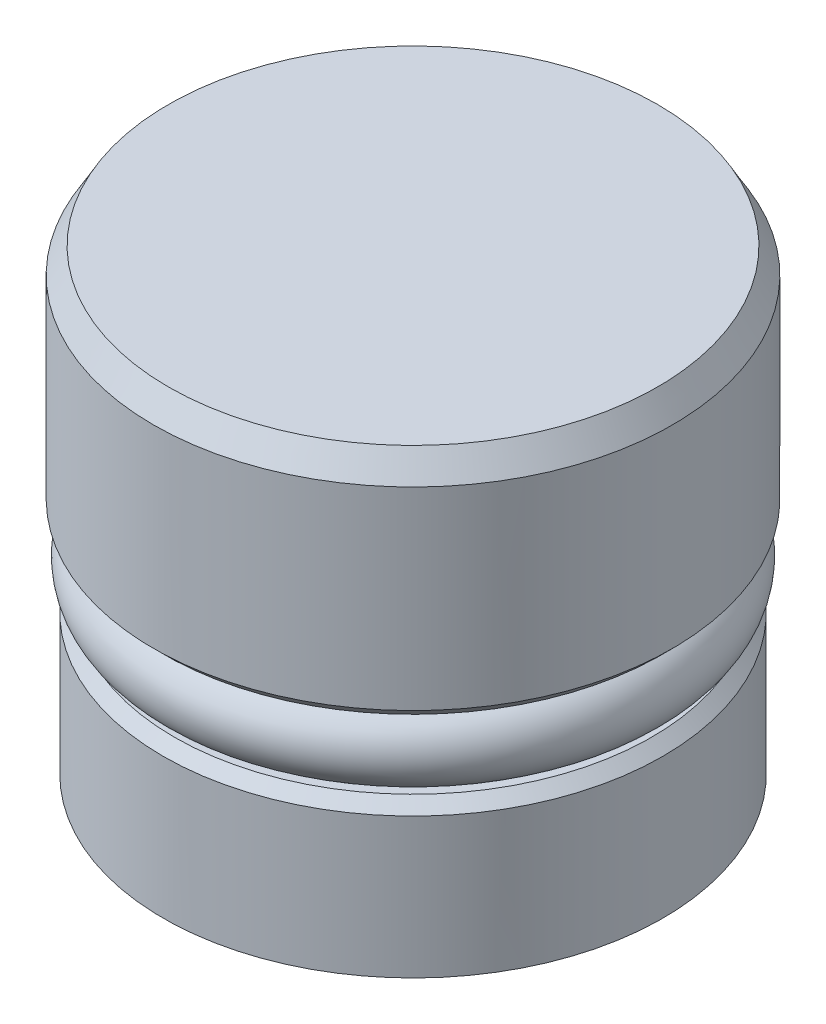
ISO-10303-21;
HEADER;
FILE_DESCRIPTION(('STEP AP214'),'2;1');
FILE_NAME('part.step','',(''),(''),'','','');
FILE_SCHEMA(('AUTOMOTIVE_DESIGN { 1 0 10303 214 1 1 1 1 }'));
ENDSEC;
DATA;
#1=APPLICATION_CONTEXT('core data for automotive mechanical design processes');
#2=APPLICATION_PROTOCOL_DEFINITION('international standard','automotive_design',2000,#1);
#3=PRODUCT_CONTEXT('',#1,'mechanical');
#4=PRODUCT('Part','Part','',(#3));
#5=PRODUCT_RELATED_PRODUCT_CATEGORY('part','',(#4));
#6=PRODUCT_DEFINITION_FORMATION('','',#4);
#7=PRODUCT_DEFINITION_CONTEXT('part definition',#1,'design');
#8=PRODUCT_DEFINITION('design','',#6,#7);
#9=PRODUCT_DEFINITION_SHAPE('','',#8);
#10=(LENGTH_UNIT() NAMED_UNIT(*) SI_UNIT(.MILLI.,.METRE.));
#11=(NAMED_UNIT(*) PLANE_ANGLE_UNIT() SI_UNIT($,.RADIAN.));
#12=(NAMED_UNIT(*) SI_UNIT($,.STERADIAN.) SOLID_ANGLE_UNIT());
#13=UNCERTAINTY_MEASURE_WITH_UNIT(LENGTH_MEASURE(1.E-05),#10,'distance_accuracy_value','');
#14=(GEOMETRIC_REPRESENTATION_CONTEXT(3) GLOBAL_UNCERTAINTY_ASSIGNED_CONTEXT((#13)) GLOBAL_UNIT_ASSIGNED_CONTEXT((#10,
#11,#12)) REPRESENTATION_CONTEXT('',''));
#15=CARTESIAN_POINT('',(0.,0.,0.));
#16=DIRECTION('',(0.,0.,1.));
#17=DIRECTION('',(1.,0.,0.));
#18=AXIS2_PLACEMENT_3D('',#15,#16,#17);
#19=CARTESIAN_POINT('',(0.,0.,0.));
#20=DIRECTION('',(0.,-1.,0.));
#21=DIRECTION('',(0.,0.,-1.));
#22=AXIS2_PLACEMENT_3D('',#19,#20,#21);
#23=PLANE('',#22);
#24=CARTESIAN_POINT('',(0.,0.,0.));
#25=DIRECTION('',(0.,-1.,0.));
#26=DIRECTION('',(0.,0.,-1.));
#27=AXIS2_PLACEMENT_3D('',#24,#25,#26);
#28=CIRCLE('',#27,5.5518939);
#29=CARTESIAN_POINT('',(0.,0.,-5.5518939));
#30=VERTEX_POINT('',#29);
#31=EDGE_CURVE('P0_E35',#30,#30,#28,.T.);
#32=ORIENTED_EDGE('',*,*,#31,.F.);
#33=EDGE_LOOP('',(#32));
#34=FACE_BOUND('',#33,.T.);
#35=CARTESIAN_POINT('',(0.,0.,0.));
#36=DIRECTION('',(0.,-1.,0.));
#37=DIRECTION('',(0.,0.,-1.));
#38=AXIS2_PLACEMENT_3D('',#35,#36,#37);
#39=CIRCLE('',#38,8.5979);
#40=CARTESIAN_POINT('',(0.,0.,-8.5979));
#41=VERTEX_POINT('',#40);
#42=EDGE_CURVE('P0_E55',#41,#41,#39,.T.);
#43=ORIENTED_EDGE('',*,*,#42,.T.);
#44=EDGE_LOOP('',(#43));
#45=FACE_BOUND('',#44,.T.);
#46=ADVANCED_FACE('P0_F15',(#34,#45),#23,.T.);
#47=CARTESIAN_POINT('',(0.,0.,0.));
#48=DIRECTION('',(0.,-1.,0.));
#49=DIRECTION('',(0.,0.,-1.));
#50=AXIS2_PLACEMENT_3D('',#47,#48,#49);
#51=CYLINDRICAL_SURFACE('',#50,8.5979);
#52=CARTESIAN_POINT('',(0.,4.826,0.));
#53=DIRECTION('',(0.,1.,0.));
#54=DIRECTION('',(0.,0.,1.));
#55=AXIS2_PLACEMENT_3D('',#52,#53,#54);
#56=CIRCLE('',#55,8.5979);
#57=CARTESIAN_POINT('',(0.,4.826,8.5979));
#58=VERTEX_POINT('',#57);
#59=EDGE_CURVE('P0_E58',#58,#58,#56,.F.);
#60=ORIENTED_EDGE('',*,*,#59,.T.);
#61=EDGE_LOOP('',(#60));
#62=FACE_BOUND('',#61,.T.);
#63=ORIENTED_EDGE('',*,*,#42,.F.);
#64=EDGE_LOOP('',(#63));
#65=FACE_BOUND('',#64,.T.);
#66=ADVANCED_FACE('P0_F86',(#62,#65),#51,.T.);
#67=CARTESIAN_POINT('',(8.5979,5.207,0.));
#68=DIRECTION('',(0.,1.,0.));
#69=DIRECTION('',(0.,0.,1.));
#70=AXIS2_PLACEMENT_3D('',#67,#68,#69);
#71=PLANE('',#70);
#72=CARTESIAN_POINT('',(0.,5.207,0.));
#73=DIRECTION('',(0.,1.,0.));
#74=DIRECTION('',(0.,0.,1.));
#75=AXIS2_PLACEMENT_3D('',#72,#73,#74);
#76=CIRCLE('',#75,8.2169);
#77=CARTESIAN_POINT('',(0.,5.207,8.2169));
#78=VERTEX_POINT('',#77);
#79=EDGE_CURVE('P0_E61',#78,#78,#76,.T.);
#80=ORIENTED_EDGE('',*,*,#79,.T.);
#81=EDGE_LOOP('',(#80));
#82=FACE_BOUND('',#81,.T.);
#83=CARTESIAN_POINT('',(0.,5.207,0.));
#84=DIRECTION('',(0.,-1.,0.));
#85=DIRECTION('',(0.,0.,-1.));
#86=AXIS2_PLACEMENT_3D('',#83,#84,#85);
#87=CIRCLE('',#86,6.0579);
#88=CARTESIAN_POINT('',(0.,5.207,-6.0579));
#89=VERTEX_POINT('',#88);
#90=EDGE_CURVE('P0_E52',#89,#89,#87,.T.);
#91=ORIENTED_EDGE('',*,*,#90,.T.);
#92=EDGE_LOOP('',(#91));
#93=FACE_BOUND('',#92,.T.);
#94=ADVANCED_FACE('P0_F92',(#82,#93),#71,.T.);
#95=CARTESIAN_POINT('',(0.,0.,0.));
#96=DIRECTION('',(0.,-1.,0.));
#97=DIRECTION('',(0.,0.,-1.));
#98=AXIS2_PLACEMENT_3D('',#95,#96,#97);
#99=CYLINDRICAL_SURFACE('',#98,6.0579);
#100=CARTESIAN_POINT('',(0.,7.8232,0.));
#101=DIRECTION('',(0.,-1.,0.));
#102=DIRECTION('',(0.,0.,-1.));
#103=AXIS2_PLACEMENT_3D('',#100,#101,#102);
#104=CIRCLE('',#103,6.0579);
#105=CARTESIAN_POINT('',(0.,7.8232,-6.0579));
#106=VERTEX_POINT('',#105);
#107=EDGE_CURVE('P0_E49',#106,#106,#104,.T.);
#108=ORIENTED_EDGE('',*,*,#107,.T.);
#109=EDGE_LOOP('',(#108));
#110=FACE_BOUND('',#109,.T.);
#111=ORIENTED_EDGE('',*,*,#90,.F.);
#112=EDGE_LOOP('',(#111));
#113=FACE_BOUND('',#112,.T.);
#114=ADVANCED_FACE('P0_F113',(#110,#113),#99,.T.);
#115=CARTESIAN_POINT('',(6.0579,7.8232,0.));
#116=DIRECTION('',(0.,-1.,0.));
#117=DIRECTION('',(0.,0.,-1.));
#118=AXIS2_PLACEMENT_3D('',#115,#116,#117);
#119=PLANE('',#118);
#120=CARTESIAN_POINT('',(0.,7.8232,0.));
#121=DIRECTION('',(0.,-1.,0.));
#122=DIRECTION('',(0.,0.,-1.));
#123=AXIS2_PLACEMENT_3D('',#120,#121,#122);
#124=CIRCLE('',#123,8.5471);
#125=CARTESIAN_POINT('',(0.,7.8232,-8.5471));
#126=VERTEX_POINT('',#125);
#127=EDGE_CURVE('P0_E64',#126,#126,#124,.T.);
#128=ORIENTED_EDGE('',*,*,#127,.T.);
#129=EDGE_LOOP('',(#128));
#130=FACE_BOUND('',#129,.T.);
#131=ORIENTED_EDGE('',*,*,#107,.F.);
#132=EDGE_LOOP('',(#131));
#133=FACE_BOUND('',#132,.T.);
#134=ADVANCED_FACE('P0_F117',(#130,#133),#119,.T.);
#135=CARTESIAN_POINT('',(0.,0.,0.));
#136=DIRECTION('',(0.,-1.,0.));
#137=DIRECTION('',(0.,0.,-1.));
#138=AXIS2_PLACEMENT_3D('',#135,#136,#137);
#139=CYLINDRICAL_SURFACE('',#138,8.9281);
#140=CARTESIAN_POINT('',(0.,14.868118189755,0.));
#141=DIRECTION('',(0.,1.,0.));
#142=DIRECTION('',(0.,0.,1.));
#143=AXIS2_PLACEMENT_3D('',#140,#141,#142);
#144=CIRCLE('',#143,8.9281);
#145=CARTESIAN_POINT('',(0.,14.868118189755,8.9281));
#146=VERTEX_POINT('',#145);
#147=EDGE_CURVE('P0_E22',#146,#146,#144,.F.);
#148=ORIENTED_EDGE('',*,*,#147,.T.);
#149=EDGE_LOOP('',(#148));
#150=FACE_BOUND('',#149,.T.);
#151=CARTESIAN_POINT('',(0.,8.2042,0.));
#152=DIRECTION('',(0.,-1.,0.));
#153=DIRECTION('',(0.,0.,-1.));
#154=AXIS2_PLACEMENT_3D('',#151,#152,#153);
#155=CIRCLE('',#154,8.9281);
#156=CARTESIAN_POINT('',(0.,8.2042,-8.9281));
#157=VERTEX_POINT('',#156);
#158=EDGE_CURVE('P0_E67',#157,#157,#155,.F.);
#159=ORIENTED_EDGE('',*,*,#158,.T.);
#160=EDGE_LOOP('',(#159));
#161=FACE_BOUND('',#160,.T.);
#162=ADVANCED_FACE('P0_F72',(#150,#161),#139,.T.);
#163=CARTESIAN_POINT('',(8.9281,15.748,0.));
#164=DIRECTION('',(0.,1.,0.));
#165=DIRECTION('',(0.,0.,1.));
#166=AXIS2_PLACEMENT_3D('',#163,#164,#165);
#167=PLANE('',#166);
#168=CARTESIAN_POINT('',(0.,15.748,0.));
#169=DIRECTION('',(0.,1.,0.));
#170=DIRECTION('',(0.,0.,1.));
#171=AXIS2_PLACEMENT_3D('',#168,#169,#170);
#172=CIRCLE('',#171,8.4201);
#173=CARTESIAN_POINT('',(0.,15.748,8.4201));
#174=VERTEX_POINT('',#173);
#175=EDGE_CURVE('P0_E10',#174,#174,#172,.T.);
#176=ORIENTED_EDGE('',*,*,#175,.T.);
#177=EDGE_LOOP('',(#176));
#178=FACE_BOUND('',#177,.T.);
#179=ADVANCED_FACE('P0_F128',(#178),#167,.T.);
#180=CARTESIAN_POINT('',(0.,3.81,0.));
#181=DIRECTION('',(0.,1.,0.));
#182=DIRECTION('',(0.,0.,1.));
#183=AXIS2_PLACEMENT_3D('',#180,#181,#182);
#184=PLANE('',#183);
#185=CARTESIAN_POINT('',(0.,3.81,0.));
#186=DIRECTION('',(0.,-1.,0.));
#187=DIRECTION('',(0.,0.,-1.));
#188=AXIS2_PLACEMENT_3D('',#185,#186,#187);
#189=CIRCLE('',#188,2.0193);
#190=CARTESIAN_POINT('',(0.,3.81,-2.0193));
#191=VERTEX_POINT('',#190);
#192=EDGE_CURVE('P0_E36',#191,#191,#189,.T.);
#193=ORIENTED_EDGE('',*,*,#192,.F.);
#194=EDGE_LOOP('',(#193));
#195=FACE_BOUND('',#194,.T.);
#196=CARTESIAN_POINT('',(0.,3.81,0.));
#197=DIRECTION('',(0.,-1.,0.));
#198=DIRECTION('',(0.,0.,-1.));
#199=AXIS2_PLACEMENT_3D('',#196,#197,#198);
#200=CIRCLE('',#199,2.5527);
#201=CARTESIAN_POINT('',(0.,3.81,-2.5527));
#202=VERTEX_POINT('',#201);
#203=EDGE_CURVE('P0_E46',#202,#202,#200,.T.);
#204=ORIENTED_EDGE('',*,*,#203,.T.);
#205=EDGE_LOOP('',(#204));
#206=FACE_BOUND('',#205,.T.);
#207=ADVANCED_FACE('P0_F131',(#195,#206),#184,.F.);
#208=CARTESIAN_POINT('',(0.,0.,0.));
#209=DIRECTION('',(0.,-1.,0.));
#210=DIRECTION('',(0.,0.,-1.));
#211=AXIS2_PLACEMENT_3D('',#208,#209,#210);
#212=CYLINDRICAL_SURFACE('',#211,2.5527);
#213=ORIENTED_EDGE('',*,*,#203,.F.);
#214=EDGE_LOOP('',(#213));
#215=FACE_BOUND('',#214,.T.);
#216=CARTESIAN_POINT('',(0.,3.45017790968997,0.));
#217=DIRECTION('',(0.,-1.,0.));
#218=DIRECTION('',(0.,0.,-1.));
#219=AXIS2_PLACEMENT_3D('',#216,#217,#218);
#220=CIRCLE('',#219,2.5527);
#221=CARTESIAN_POINT('',(0.,3.45017790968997,-2.5527));
#222=VERTEX_POINT('',#221);
#223=EDGE_CURVE('P0_E39',#222,#222,#220,.T.);
#224=ORIENTED_EDGE('',*,*,#223,.T.);
#225=EDGE_LOOP('',(#224));
#226=FACE_BOUND('',#225,.T.);
#227=ADVANCED_FACE('P0_F135',(#215,#226),#212,.F.);
#228=CARTESIAN_POINT('',(0.,0.,0.));
#229=DIRECTION('',(0.,-1.,0.));
#230=DIRECTION('',(0.,0.,-1.));
#231=AXIS2_PLACEMENT_3D('',#228,#229,#230);
#232=CONICAL_SURFACE('',#231,5.5518939,0.715584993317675);
#233=ORIENTED_EDGE('',*,*,#223,.F.);
#234=EDGE_LOOP('',(#233));
#235=FACE_BOUND('',#234,.T.);
#236=ORIENTED_EDGE('',*,*,#31,.T.);
#237=EDGE_LOOP('',(#236));
#238=FACE_BOUND('',#237,.T.);
#239=ADVANCED_FACE('P0_F29',(#235,#238),#232,.F.);
#240=CARTESIAN_POINT('',(0.,11.684,0.));
#241=DIRECTION('',(0.,-1.,0.));
#242=DIRECTION('',(0.,0.,-1.));
#243=AXIS2_PLACEMENT_3D('',#240,#241,#242);
#244=CONICAL_SURFACE('',#243,2.0193,1.02974425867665);
#245=CARTESIAN_POINT('',(0.,12.8973178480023,0.));
#246=VERTEX_POINT('',#245);
#247=VERTEX_LOOP('',#246);
#248=FACE_BOUND('',#247,.T.);
#249=CARTESIAN_POINT('',(0.,11.684,0.));
#250=DIRECTION('',(0.,-1.,0.));
#251=DIRECTION('',(0.,0.,-1.));
#252=AXIS2_PLACEMENT_3D('',#249,#250,#251);
#253=CIRCLE('',#252,2.0193);
#254=CARTESIAN_POINT('',(0.,11.684,-2.0193));
#255=VERTEX_POINT('',#254);
#256=EDGE_CURVE('P0_E33',#255,#255,#253,.T.);
#257=ORIENTED_EDGE('',*,*,#256,.T.);
#258=EDGE_LOOP('',(#257));
#259=FACE_BOUND('',#258,.T.);
#260=ADVANCED_FACE('P0_F25',(#248,#259),#244,.F.);
#261=CARTESIAN_POINT('',(0.,3.81,0.));
#262=DIRECTION('',(0.,-1.,0.));
#263=DIRECTION('',(0.,0.,-1.));
#264=AXIS2_PLACEMENT_3D('',#261,#262,#263);
#265=CYLINDRICAL_SURFACE('',#264,2.0193);
#266=ORIENTED_EDGE('',*,*,#256,.F.);
#267=EDGE_LOOP('',(#266));
#268=FACE_BOUND('',#267,.T.);
#269=ORIENTED_EDGE('',*,*,#192,.T.);
#270=EDGE_LOOP('',(#269));
#271=FACE_BOUND('',#270,.T.);
#272=ADVANCED_FACE('P0_F28',(#268,#271),#265,.F.);
#273=CARTESIAN_POINT('',(0.,4.826,0.));
#274=DIRECTION('',(0.,-1.,0.));
#275=DIRECTION('',(0.,0.,-1.));
#276=AXIS2_PLACEMENT_3D('',#273,#274,#275);
#277=CONICAL_SURFACE('',#276,8.5979,0.785398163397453);
#278=ORIENTED_EDGE('',*,*,#79,.F.);
#279=EDGE_LOOP('',(#278));
#280=FACE_BOUND('',#279,.T.);
#281=ORIENTED_EDGE('',*,*,#59,.F.);
#282=EDGE_LOOP('',(#281));
#283=FACE_BOUND('',#282,.T.);
#284=ADVANCED_FACE('P0_F82',(#280,#283),#277,.T.);
#285=CARTESIAN_POINT('',(0.,7.8232,0.));
#286=DIRECTION('',(0.,1.,0.));
#287=DIRECTION('',(0.,0.,1.));
#288=AXIS2_PLACEMENT_3D('',#285,#286,#287);
#289=CONICAL_SURFACE('',#288,8.5471,0.785398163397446);
#290=ORIENTED_EDGE('',*,*,#158,.F.);
#291=EDGE_LOOP('',(#290));
#292=FACE_BOUND('',#291,.T.);
#293=ORIENTED_EDGE('',*,*,#127,.F.);
#294=EDGE_LOOP('',(#293));
#295=FACE_BOUND('',#294,.T.);
#296=ADVANCED_FACE('P0_F76',(#292,#295),#289,.T.);
#297=CARTESIAN_POINT('',(0.,14.868118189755,0.));
#298=DIRECTION('',(0.,-1.,0.));
#299=DIRECTION('',(0.,0.,-1.));
#300=AXIS2_PLACEMENT_3D('',#297,#298,#299);
#301=CONICAL_SURFACE('',#300,8.9281,0.5235987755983);
#302=ORIENTED_EDGE('',*,*,#175,.F.);
#303=EDGE_LOOP('',(#302));
#304=FACE_BOUND('',#303,.T.);
#305=ORIENTED_EDGE('',*,*,#147,.F.);
#306=EDGE_LOOP('',(#305));
#307=FACE_BOUND('',#306,.T.);
#308=ADVANCED_FACE('P0_F17',(#304,#307),#301,.T.);
#309=CLOSED_SHELL('',(#46,#66,#94,#114,#134,#162,#179,#207,#227,#239,#260,#272,#284,#296,#308));
#310=MANIFOLD_SOLID_BREP('P0_B1',#309);
#311=CARTESIAN_POINT('',(0.,6.5151,0.));
#312=DIRECTION('',(0.,-1.,0.));
#313=DIRECTION('',(0.,0.,-1.));
#314=AXIS2_PLACEMENT_3D('',#311,#312,#313);
#315=TOROIDAL_SURFACE('',#314,7.493,1.3081);
#316=CARTESIAN_POINT('',(0.,6.5151,-8.8011));
#317=VERTEX_POINT('',#316);
#318=VERTEX_LOOP('',#317);
#319=FACE_BOUND('',#318,.T.);
#320=ADVANCED_FACE('P1_F12',(#319),#315,.T.);
#321=CLOSED_SHELL('',(#320));
#322=MANIFOLD_SOLID_BREP('P1_B1',#321);
#323=CARTESIAN_POINT('',(0.,0.382145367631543,5.2197));
#324=DIRECTION('',(0.,-1.,0.));
#325=DIRECTION('',(-1.,0.,0.));
#326=AXIS2_PLACEMENT_3D('',#323,#324,#325);
#327=PLANE('',#326);
#328=DIRECTION('',(0.866025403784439,0.,0.5));
#329=VECTOR('',#328,1.);
#330=CARTESIAN_POINT('',(0.,0.382145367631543,-1.83308710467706));
#331=LINE('',#330,#329);
#332=CARTESIAN_POINT('',(0.,0.382145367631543,-1.83308710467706));
#333=VERTEX_POINT('',#332);
#334=CARTESIAN_POINT('',(1.5875,0.382145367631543,-0.916543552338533));
#335=VERTEX_POINT('',#334);
#336=EDGE_CURVE('P2_E29',#333,#335,#331,.T.);
#337=ORIENTED_EDGE('',*,*,#336,.F.);
#338=DIRECTION('',(0.866025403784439,0.,-0.5));
#339=VECTOR('',#338,1.);
#340=CARTESIAN_POINT('',(-1.5875,0.382145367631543,-0.916543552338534));
#341=LINE('',#340,#339);
#342=CARTESIAN_POINT('',(-1.5875,0.382145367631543,-0.916543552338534));
#343=VERTEX_POINT('',#342);
#344=EDGE_CURVE('P2_E112',#343,#333,#341,.T.);
#345=ORIENTED_EDGE('',*,*,#344,.F.);
#346=DIRECTION('',(0.,0.,-1.));
#347=VECTOR('',#346,1.);
#348=CARTESIAN_POINT('',(-1.5875,0.382145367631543,0.916543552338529));
#349=LINE('',#348,#347);
#350=CARTESIAN_POINT('',(-1.5875,0.382145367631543,0.916543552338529));
#351=VERTEX_POINT('',#350);
#352=EDGE_CURVE('P2_E110',#351,#343,#349,.T.);
#353=ORIENTED_EDGE('',*,*,#352,.F.);
#354=DIRECTION('',(-0.866025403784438,0.,-0.5));
#355=VECTOR('',#354,1.);
#356=CARTESIAN_POINT('',(0.,0.382145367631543,1.83308710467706));
#357=LINE('',#356,#355);
#358=CARTESIAN_POINT('',(0.,0.382145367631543,1.83308710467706));
#359=VERTEX_POINT('',#358);
#360=EDGE_CURVE('P2_E77',#359,#351,#357,.T.);
#361=ORIENTED_EDGE('',*,*,#360,.F.);
#362=DIRECTION('',(-0.866025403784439,0.,0.5));
#363=VECTOR('',#362,1.);
#364=CARTESIAN_POINT('',(1.5875,0.382145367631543,0.916543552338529));
#365=LINE('',#364,#363);
#366=CARTESIAN_POINT('',(1.5875,0.382145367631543,0.916543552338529));
#367=VERTEX_POINT('',#366);
#368=EDGE_CURVE('P2_E106',#367,#359,#365,.T.);
#369=ORIENTED_EDGE('',*,*,#368,.F.);
#370=DIRECTION('',(0.,0.,1.));
#371=VECTOR('',#370,1.);
#372=CARTESIAN_POINT('',(1.5875,0.382145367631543,-0.916543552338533));
#373=LINE('',#372,#371);
#374=EDGE_CURVE('P2_E103',#335,#367,#373,.T.);
#375=ORIENTED_EDGE('',*,*,#374,.F.);
#376=EDGE_LOOP('',(#337,#345,#353,#361,#369,#375));
#377=FACE_BOUND('',#376,.T.);
#378=CARTESIAN_POINT('',(0.,0.382145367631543,0.));
#379=DIRECTION('',(0.,1.,0.));
#380=DIRECTION('',(1.,0.,0.));
#381=AXIS2_PLACEMENT_3D('',#378,#379,#380);
#382=CIRCLE('',#381,5.2197);
#383=CARTESIAN_POINT('',(5.2197,0.382145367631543,0.));
#384=VERTEX_POINT('',#383);
#385=EDGE_CURVE('P2_E10',#384,#384,#382,.T.);
#386=ORIENTED_EDGE('',*,*,#385,.F.);
#387=EDGE_LOOP('',(#386));
#388=FACE_BOUND('',#387,.T.);
#389=ADVANCED_FACE('P2_F15',(#377,#388),#327,.T.);
#390=CARTESIAN_POINT('',(0.,3.61088437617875,0.));
#391=DIRECTION('',(0.,-1.,0.));
#392=DIRECTION('',(-1.,0.,0.));
#393=AXIS2_PLACEMENT_3D('',#390,#391,#392);
#394=CONICAL_SURFACE('',#393,2.413,0.715584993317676);
#395=ORIENTED_EDGE('',*,*,#385,.T.);
#396=EDGE_LOOP('',(#395));
#397=FACE_BOUND('',#396,.T.);
#398=CARTESIAN_POINT('',(0.,3.61088437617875,0.));
#399=DIRECTION('',(0.,1.,0.));
#400=DIRECTION('',(1.,0.,0.));
#401=AXIS2_PLACEMENT_3D('',#398,#399,#400);
#402=CIRCLE('',#401,2.413);
#403=CARTESIAN_POINT('',(2.413,3.61088437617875,0.));
#404=VERTEX_POINT('',#403);
#405=EDGE_CURVE('P2_E22',#404,#404,#402,.T.);
#406=ORIENTED_EDGE('',*,*,#405,.F.);
#407=EDGE_LOOP('',(#406));
#408=FACE_BOUND('',#407,.T.);
#409=ADVANCED_FACE('P2_F129',(#397,#408),#394,.T.);
#410=CARTESIAN_POINT('',(0.,9.90714536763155,0.));
#411=DIRECTION('',(0.,1.,0.));
#412=DIRECTION('',(1.,0.,0.));
#413=AXIS2_PLACEMENT_3D('',#410,#411,#412);
#414=CYLINDRICAL_SURFACE('',#413,2.413);
#415=ORIENTED_EDGE('',*,*,#405,.T.);
#416=EDGE_LOOP('',(#415));
#417=FACE_BOUND('',#416,.T.);
#418=CARTESIAN_POINT('',(0.,9.90714536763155,0.));
#419=DIRECTION('',(0.,1.,0.));
#420=DIRECTION('',(1.,0.,0.));
#421=AXIS2_PLACEMENT_3D('',#418,#419,#420);
#422=CIRCLE('',#421,2.413);
#423=CARTESIAN_POINT('',(2.413,9.90714536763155,0.));
#424=VERTEX_POINT('',#423);
#425=EDGE_CURVE('P2_E116',#424,#424,#422,.T.);
#426=ORIENTED_EDGE('',*,*,#425,.F.);
#427=EDGE_LOOP('',(#426));
#428=FACE_BOUND('',#427,.T.);
#429=ADVANCED_FACE('P2_F126',(#417,#428),#414,.T.);
#430=CARTESIAN_POINT('',(0.,9.90714536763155,0.));
#431=DIRECTION('',(0.,1.,0.));
#432=DIRECTION('',(1.,0.,0.));
#433=AXIS2_PLACEMENT_3D('',#430,#431,#432);
#434=PLANE('',#433);
#435=ORIENTED_EDGE('',*,*,#425,.T.);
#436=EDGE_LOOP('',(#435));
#437=FACE_BOUND('',#436,.T.);
#438=ADVANCED_FACE('P2_F137',(#437),#434,.T.);
#439=CARTESIAN_POINT('',(0.,3.43014536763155,-1.83308710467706));
#440=DIRECTION('',(0.5,0.,-0.866025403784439));
#441=DIRECTION('',(-0.866025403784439,0.,-0.5));
#442=AXIS2_PLACEMENT_3D('',#439,#440,#441);
#443=PLANE('',#442);
#444=ORIENTED_EDGE('',*,*,#336,.T.);
#445=DIRECTION('',(0.,-1.,0.));
#446=VECTOR('',#445,1.);
#447=CARTESIAN_POINT('',(1.5875,3.43014536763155,-0.916543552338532));
#448=LINE('',#447,#446);
#449=CARTESIAN_POINT('',(1.5875,3.43014536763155,-0.916543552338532));
#450=VERTEX_POINT('',#449);
#451=EDGE_CURVE('P2_E59',#450,#335,#448,.T.);
#452=ORIENTED_EDGE('',*,*,#451,.F.);
#453=DIRECTION('',(0.866025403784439,0.,0.5));
#454=VECTOR('',#453,1.);
#455=CARTESIAN_POINT('',(0.,3.43014536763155,-1.83308710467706));
#456=LINE('',#455,#454);
#457=CARTESIAN_POINT('',(0.,3.43014536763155,-1.83308710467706));
#458=VERTEX_POINT('',#457);
#459=EDGE_CURVE('P2_E114',#458,#450,#456,.T.);
#460=ORIENTED_EDGE('',*,*,#459,.F.);
#461=DIRECTION('',(0.,-1.,0.));
#462=VECTOR('',#461,1.);
#463=CARTESIAN_POINT('',(0.,3.43014536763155,-1.83308710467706));
#464=LINE('',#463,#462);
#465=EDGE_CURVE('P2_E37',#458,#333,#464,.T.);
#466=ORIENTED_EDGE('',*,*,#465,.T.);
#467=EDGE_LOOP('',(#444,#452,#460,#466));
#468=FACE_BOUND('',#467,.T.);
#469=ADVANCED_FACE('P2_F143',(#468),#443,.F.);
#470=CARTESIAN_POINT('',(-1.5875,3.43014536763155,-0.916543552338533));
#471=DIRECTION('',(-0.5,0.,-0.866025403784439));
#472=DIRECTION('',(-0.866025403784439,0.,0.5));
#473=AXIS2_PLACEMENT_3D('',#470,#471,#472);
#474=PLANE('',#473);
#475=ORIENTED_EDGE('',*,*,#344,.T.);
#476=ORIENTED_EDGE('',*,*,#465,.F.);
#477=DIRECTION('',(0.866025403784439,0.,-0.5));
#478=VECTOR('',#477,1.);
#479=CARTESIAN_POINT('',(-1.5875,3.43014536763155,-0.916543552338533));
#480=LINE('',#479,#478);
#481=CARTESIAN_POINT('',(-1.5875,3.43014536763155,-0.916543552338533));
#482=VERTEX_POINT('',#481);
#483=EDGE_CURVE('P2_E89',#482,#458,#480,.T.);
#484=ORIENTED_EDGE('',*,*,#483,.F.);
#485=DIRECTION('',(0.,-1.,0.));
#486=VECTOR('',#485,1.);
#487=CARTESIAN_POINT('',(-1.5875,3.43014536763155,-0.916543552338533));
#488=LINE('',#487,#486);
#489=EDGE_CURVE('P2_E81',#482,#343,#488,.T.);
#490=ORIENTED_EDGE('',*,*,#489,.T.);
#491=EDGE_LOOP('',(#475,#476,#484,#490));
#492=FACE_BOUND('',#491,.T.);
#493=ADVANCED_FACE('P2_F147',(#492),#474,.F.);
#494=CARTESIAN_POINT('',(-1.5875,3.43014536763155,0.916543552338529));
#495=DIRECTION('',(-1.,0.,0.));
#496=DIRECTION('',(0.,0.,1.));
#497=AXIS2_PLACEMENT_3D('',#494,#495,#496);
#498=PLANE('',#497);
#499=ORIENTED_EDGE('',*,*,#352,.T.);
#500=ORIENTED_EDGE('',*,*,#489,.F.);
#501=DIRECTION('',(0.,0.,-1.));
#502=VECTOR('',#501,1.);
#503=CARTESIAN_POINT('',(-1.5875,3.43014536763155,0.916543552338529));
#504=LINE('',#503,#502);
#505=CARTESIAN_POINT('',(-1.5875,3.43014536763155,0.916543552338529));
#506=VERTEX_POINT('',#505);
#507=EDGE_CURVE('P2_E85',#506,#482,#504,.T.);
#508=ORIENTED_EDGE('',*,*,#507,.F.);
#509=DIRECTION('',(0.,-1.,0.));
#510=VECTOR('',#509,1.);
#511=CARTESIAN_POINT('',(-1.5875,3.43014536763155,0.916543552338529));
#512=LINE('',#511,#510);
#513=EDGE_CURVE('P2_E70',#506,#351,#512,.T.);
#514=ORIENTED_EDGE('',*,*,#513,.T.);
#515=EDGE_LOOP('',(#499,#500,#508,#514));
#516=FACE_BOUND('',#515,.T.);
#517=ADVANCED_FACE('P2_F86',(#516),#498,.F.);
#518=CARTESIAN_POINT('',(0.,3.43014536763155,1.83308710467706));
#519=DIRECTION('',(-0.5,0.,0.866025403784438));
#520=DIRECTION('',(0.866025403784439,0.,0.5));
#521=AXIS2_PLACEMENT_3D('',#518,#519,#520);
#522=PLANE('',#521);
#523=ORIENTED_EDGE('',*,*,#360,.T.);
#524=ORIENTED_EDGE('',*,*,#513,.F.);
#525=DIRECTION('',(-0.866025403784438,0.,-0.5));
#526=VECTOR('',#525,1.);
#527=CARTESIAN_POINT('',(0.,3.43014536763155,1.83308710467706));
#528=LINE('',#527,#526);
#529=CARTESIAN_POINT('',(0.,3.43014536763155,1.83308710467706));
#530=VERTEX_POINT('',#529);
#531=EDGE_CURVE('P2_E74',#530,#506,#528,.T.);
#532=ORIENTED_EDGE('',*,*,#531,.F.);
#533=DIRECTION('',(0.,-1.,0.));
#534=VECTOR('',#533,1.);
#535=CARTESIAN_POINT('',(0.,3.43014536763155,1.83308710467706));
#536=LINE('',#535,#534);
#537=EDGE_CURVE('P2_E82',#530,#359,#536,.T.);
#538=ORIENTED_EDGE('',*,*,#537,.T.);
#539=EDGE_LOOP('',(#523,#524,#532,#538));
#540=FACE_BOUND('',#539,.T.);
#541=ADVANCED_FACE('P2_F72',(#540),#522,.F.);
#542=CARTESIAN_POINT('',(1.5875,3.43014536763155,0.91654355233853));
#543=DIRECTION('',(0.5,0.,0.866025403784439));
#544=DIRECTION('',(0.866025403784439,0.,-0.5));
#545=AXIS2_PLACEMENT_3D('',#542,#543,#544);
#546=PLANE('',#545);
#547=ORIENTED_EDGE('',*,*,#368,.T.);
#548=ORIENTED_EDGE('',*,*,#537,.F.);
#549=DIRECTION('',(-0.866025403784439,0.,0.5));
#550=VECTOR('',#549,1.);
#551=CARTESIAN_POINT('',(1.5875,3.43014536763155,0.91654355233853));
#552=LINE('',#551,#550);
#553=CARTESIAN_POINT('',(1.5875,3.43014536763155,0.91654355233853));
#554=VERTEX_POINT('',#553);
#555=EDGE_CURVE('P2_E95',#554,#530,#552,.T.);
#556=ORIENTED_EDGE('',*,*,#555,.F.);
#557=DIRECTION('',(0.,-1.,0.));
#558=VECTOR('',#557,1.);
#559=CARTESIAN_POINT('',(1.5875,3.43014536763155,0.91654355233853));
#560=LINE('',#559,#558);
#561=EDGE_CURVE('P2_E119',#554,#367,#560,.T.);
#562=ORIENTED_EDGE('',*,*,#561,.T.);
#563=EDGE_LOOP('',(#547,#548,#556,#562));
#564=FACE_BOUND('',#563,.T.);
#565=ADVANCED_FACE('P2_F151',(#564),#546,.F.);
#566=CARTESIAN_POINT('',(1.5875,3.43014536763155,-0.916543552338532));
#567=DIRECTION('',(1.,0.,0.));
#568=DIRECTION('',(0.,-1.,0.));
#569=AXIS2_PLACEMENT_3D('',#566,#567,#568);
#570=PLANE('',#569);
#571=ORIENTED_EDGE('',*,*,#374,.T.);
#572=ORIENTED_EDGE('',*,*,#561,.F.);
#573=DIRECTION('',(0.,0.,1.));
#574=VECTOR('',#573,1.);
#575=CARTESIAN_POINT('',(1.5875,3.43014536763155,-0.916543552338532));
#576=LINE('',#575,#574);
#577=EDGE_CURVE('P2_E97',#450,#554,#576,.T.);
#578=ORIENTED_EDGE('',*,*,#577,.F.);
#579=ORIENTED_EDGE('',*,*,#451,.T.);
#580=EDGE_LOOP('',(#571,#572,#578,#579));
#581=FACE_BOUND('',#580,.T.);
#582=ADVANCED_FACE('P2_F148',(#581),#570,.F.);
#583=CARTESIAN_POINT('',(3.175,3.43014536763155,0.));
#584=DIRECTION('',(0.,-1.,0.));
#585=DIRECTION('',(-1.,0.,0.));
#586=AXIS2_PLACEMENT_3D('',#583,#584,#585);
#587=PLANE('',#586);
#588=ORIENTED_EDGE('',*,*,#459,.T.);
#589=ORIENTED_EDGE('',*,*,#577,.T.);
#590=ORIENTED_EDGE('',*,*,#555,.T.);
#591=ORIENTED_EDGE('',*,*,#531,.T.);
#592=ORIENTED_EDGE('',*,*,#507,.T.);
#593=ORIENTED_EDGE('',*,*,#483,.T.);
#594=EDGE_LOOP('',(#588,#589,#590,#591,#592,#593));
#595=FACE_BOUND('',#594,.T.);
#596=ADVANCED_FACE('P2_F92',(#595),#587,.T.);
#597=CLOSED_SHELL('',(#389,#409,#429,#438,#469,#493,#517,#541,#565,#582,#596));
#598=MANIFOLD_SOLID_BREP('P2_B1',#597);
#599=ADVANCED_BREP_SHAPE_REPRESENTATION('',(#18,#310,#322,#598),#14);
#600=SHAPE_DEFINITION_REPRESENTATION(#9,#599);
ENDSEC;
END-ISO-10303-21;
